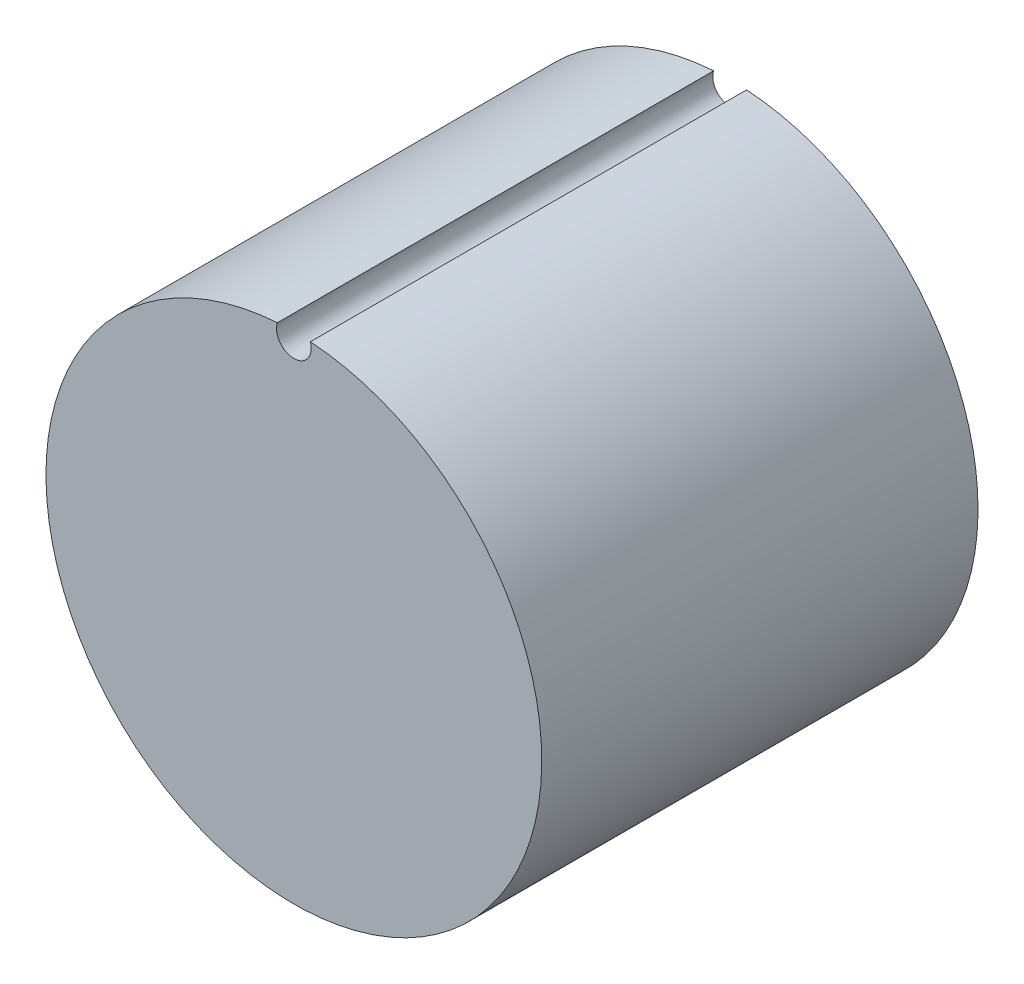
from build123d import *

# Parameters (mm, degrees)
SKIZZE1_R                       = 12.5
AUFSATZ_LINEAR_AUSTRAGEN2_DEPTH = 22
SKIZZE2_R                       = 3
SCHNITT_LINEAR_AUSTRAGEN1_DEPTH = 19
SKIZZE5_R                       = 8.5
SCHNITT_LINEAR_AUSTRAGEN3_DEPTH = 7
SKIZZE7_R                       = 0.875
SCHNITT_LINEAR_AUSTRAGEN5_DEPTH = 22


with BuildPart() as part:
    # Skizze1 → Aufsatz-Linear austragen2 (new body)
    with BuildSketch(Plane.XY):
        Circle(SKIZZE1_R)
    extrude(amount=AUFSATZ_LINEAR_AUSTRAGEN2_DEPTH)

    # Skizze2 → Schnitt-Linear austragen1 (cut)
    with BuildSketch(Plane(origin=(0, 0, 0), x_dir=(-1, 0, 0), z_dir=(0, 0, -1))):
        Circle(SKIZZE2_R)
    extrude(amount=-SCHNITT_LINEAR_AUSTRAGEN1_DEPTH, mode=Mode.SUBTRACT)

    # Skizze5 → Schnitt-Linear austragen3 (cut)
    with BuildSketch(Plane(origin=(0, 0, 0), x_dir=(-1, 0, 0), z_dir=(0, 0, -1))):
        Circle(SKIZZE5_R)
    extrude(amount=-SCHNITT_LINEAR_AUSTRAGEN3_DEPTH, mode=Mode.SUBTRACT)

    # Skizze7 → Schnitt-Linear austragen5 (cut)
    with BuildSketch(Plane.XY.offset(22)):
        with Locations((0, 12.2)):
            Circle(SKIZZE7_R)
    extrude(amount=-SCHNITT_LINEAR_AUSTRAGEN5_DEPTH, mode=Mode.SUBTRACT)


solid = part.part
